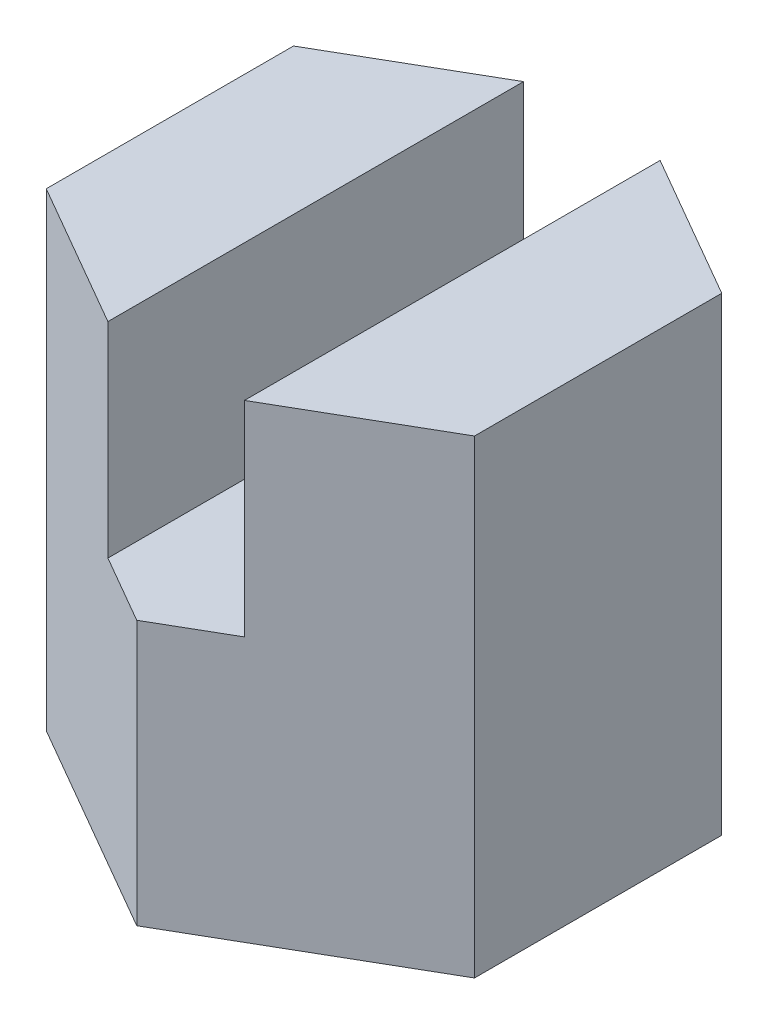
from build123d import *

# Parameters (mm, degrees)
EXTRUDE_1_DEPTH          = 110
CUT_EXTRUDE_1_DEPTH      = 135.072079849
CUT_EXTRUDE_1_DEPTH_BACK = 135.072079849
SKETCH_3_W               = 32
SKETCH_3_H               = 48


with BuildPart() as part:
    # Sketch 1 → Extrude 1 (new body)
    with BuildSketch(Plane(origin=(0, 0, 0), x_dir=(1, 0, 0), z_dir=(0, 1, 0))):
        Polygon((0, 57.942447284), (-50.179631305, 28.971223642), (-50.179631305, -28.971223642), (0, -57.942447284), (50.179631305, -28.971223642), (50.179631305, 28.971223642), align=None)
    extrude(amount=EXTRUDE_1_DEPTH)

    # Sketch 3 → Cut-Extrude 1 (cut, two sides: drawn at the far end of the back side and taken through both)
    with BuildSketch(Plane.XY.offset(-CUT_EXTRUDE_1_DEPTH_BACK)):
        with Locations((0, 86)):
            Rectangle(SKETCH_3_W, SKETCH_3_H)
    extrude(amount=CUT_EXTRUDE_1_DEPTH + CUT_EXTRUDE_1_DEPTH_BACK, mode=Mode.SUBTRACT)


solid = part.part
